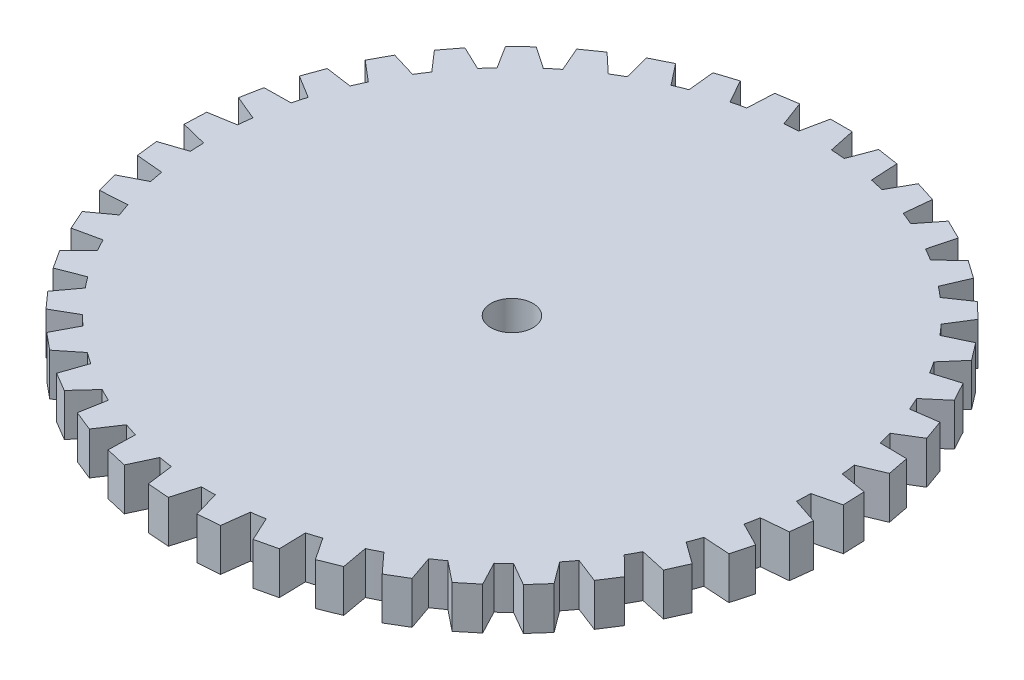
from build123d import *

# Parameters (mm, degrees)
SKETCH2_R           = 10.6
SKETCH2_R_2         = 0.735
BOSS_EXTRUDE3_DEPTH = 1.48
BOSS_EXTRUDE4_DEPTH = 1.48
CIRPATTERN11_COUNT  = 41


with BuildPart() as part:
    # Sketch2 → Boss-Extrude3 (new body)
    with BuildSketch(Plane(origin=(0, 0, 0), x_dir=(1, 0, 0), z_dir=(0, 1, 0))):
        with Locations(Location((0, 0, 0), (0, 0, 270))):
            Circle(SKETCH2_R)
        with Locations(Location((0, 0, 0), (0, 0, 270))):
            Circle(SKETCH2_R_2, mode=Mode.SUBTRACT)
    extrude(amount=BOSS_EXTRUDE3_DEPTH)

    # Sketch3 → Boss-Extrude4 (add)
    with BuildSketch(Plane(origin=(0, 1.48, 0), x_dir=(1, 0, 0), z_dir=(0, 1, 0))):
        Polygon((-0.38, 11.5), (0.38, 11.5), (0.9, 9), (-0.9, 9), align=None)
    boss_extrude4 = extrude(amount=-BOSS_EXTRUDE4_DEPTH)

    # CirPattern11: Boss-Extrude4 ×41 about axis
    cirpattern11_axis = Axis((0, 0, 0), (0, 1, 0))
    for i in range(1, CIRPATTERN11_COUNT):
        add(boss_extrude4.rotate(cirpattern11_axis, i * 360 / CIRPATTERN11_COUNT))


solid = part.part
